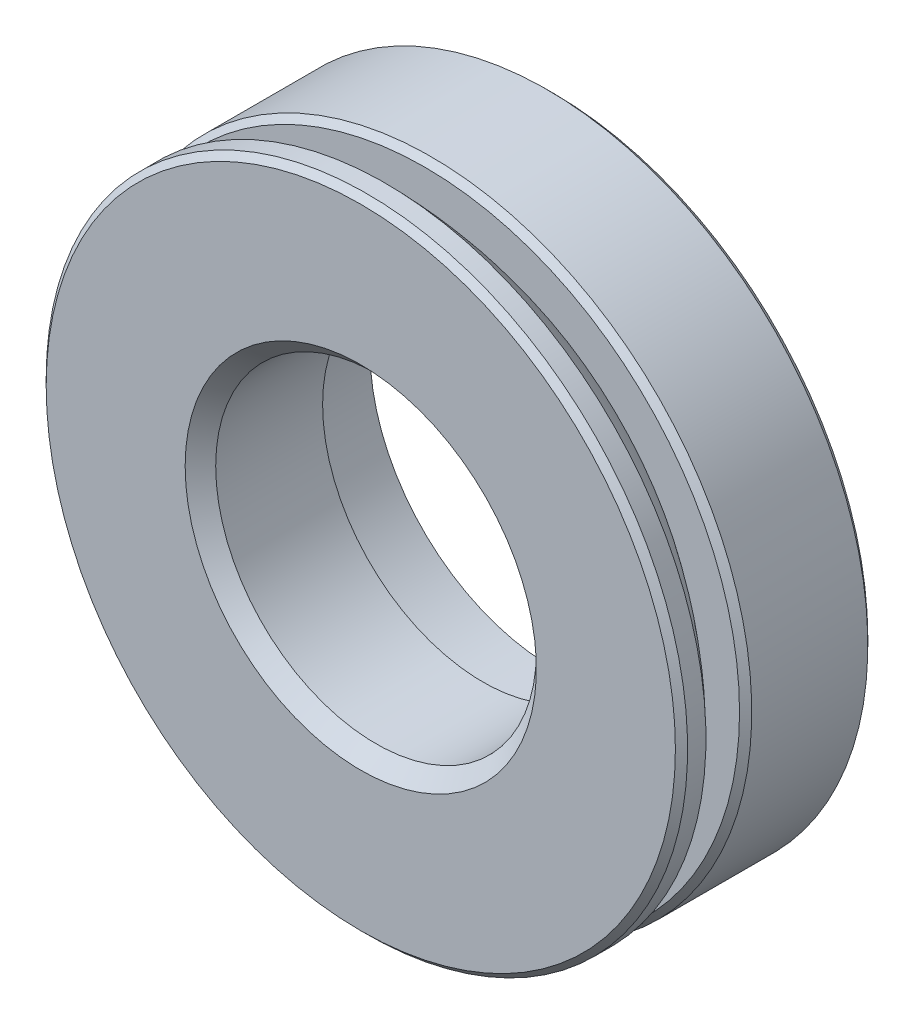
ISO-10303-21;
HEADER;
FILE_DESCRIPTION(('STEP AP214'),'2;1');
FILE_NAME('part.step','',(''),(''),'','','');
FILE_SCHEMA(('AUTOMOTIVE_DESIGN { 1 0 10303 214 1 1 1 1 }'));
ENDSEC;
DATA;
#1=APPLICATION_CONTEXT('core data for automotive mechanical design processes');
#2=APPLICATION_PROTOCOL_DEFINITION('international standard','automotive_design',2000,#1);
#3=PRODUCT_CONTEXT('',#1,'mechanical');
#4=PRODUCT('Part','Part','',(#3));
#5=PRODUCT_RELATED_PRODUCT_CATEGORY('part','',(#4));
#6=PRODUCT_DEFINITION_FORMATION('','',#4);
#7=PRODUCT_DEFINITION_CONTEXT('part definition',#1,'design');
#8=PRODUCT_DEFINITION('design','',#6,#7);
#9=PRODUCT_DEFINITION_SHAPE('','',#8);
#10=(LENGTH_UNIT() NAMED_UNIT(*) SI_UNIT(.MILLI.,.METRE.));
#11=(NAMED_UNIT(*) PLANE_ANGLE_UNIT() SI_UNIT($,.RADIAN.));
#12=(NAMED_UNIT(*) SI_UNIT($,.STERADIAN.) SOLID_ANGLE_UNIT());
#13=UNCERTAINTY_MEASURE_WITH_UNIT(LENGTH_MEASURE(1.E-05),#10,'distance_accuracy_value','');
#14=(GEOMETRIC_REPRESENTATION_CONTEXT(3) GLOBAL_UNCERTAINTY_ASSIGNED_CONTEXT((#13)) GLOBAL_UNIT_ASSIGNED_CONTEXT((#10,
#11,#12)) REPRESENTATION_CONTEXT('',''));
#15=CARTESIAN_POINT('',(0.,0.,0.));
#16=DIRECTION('',(0.,0.,1.));
#17=DIRECTION('',(1.,0.,0.));
#18=AXIS2_PLACEMENT_3D('',#15,#16,#17);
#19=CARTESIAN_POINT('',(0.,0.,8.82361162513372));
#20=DIRECTION('',(0.,0.,1.));
#21=DIRECTION('',(-1.,0.,0.));
#22=AXIS2_PLACEMENT_3D('',#19,#20,#21);
#23=CYLINDRICAL_SURFACE('',#22,6.);
#24=CARTESIAN_POINT('',(0.,0.,0.));
#25=DIRECTION('',(0.,0.,1.));
#26=DIRECTION('',(-1.,0.,0.));
#27=AXIS2_PLACEMENT_3D('',#24,#25,#26);
#28=CIRCLE('',#27,6.);
#29=CARTESIAN_POINT('',(-6.,0.,0.));
#30=VERTEX_POINT('',#29);
#31=EDGE_CURVE('E8',#30,#30,#28,.T.);
#32=ORIENTED_EDGE('',*,*,#31,.F.);
#33=EDGE_LOOP('',(#32));
#34=FACE_BOUND('',#33,.T.);
#35=CARTESIAN_POINT('',(0.,0.,2.30001162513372));
#36=DIRECTION('',(0.,0.,1.));
#37=DIRECTION('',(-1.,0.,0.));
#38=AXIS2_PLACEMENT_3D('',#35,#36,#37);
#39=CIRCLE('',#38,6.);
#40=CARTESIAN_POINT('',(-6.,0.,2.30001162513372));
#41=VERTEX_POINT('',#40);
#42=EDGE_CURVE('E56',#41,#41,#39,.T.);
#43=ORIENTED_EDGE('',*,*,#42,.T.);
#44=EDGE_LOOP('',(#43));
#45=FACE_BOUND('',#44,.T.);
#46=ADVANCED_FACE('F13',(#34,#45),#23,.F.);
#47=CARTESIAN_POINT('',(6.,0.,0.));
#48=DIRECTION('',(0.,0.,1.));
#49=DIRECTION('',(-1.,0.,0.));
#50=AXIS2_PLACEMENT_3D('',#47,#48,#49);
#51=PLANE('',#50);
#52=CARTESIAN_POINT('',(0.,0.,0.));
#53=DIRECTION('',(0.,0.,1.));
#54=DIRECTION('',(-1.,0.,0.));
#55=AXIS2_PLACEMENT_3D('',#52,#53,#54);
#56=CIRCLE('',#55,10.3);
#57=CARTESIAN_POINT('',(-10.3,0.,0.));
#58=VERTEX_POINT('',#57);
#59=EDGE_CURVE('E19',#58,#58,#56,.T.);
#60=ORIENTED_EDGE('',*,*,#59,.F.);
#61=EDGE_LOOP('',(#60));
#62=FACE_BOUND('',#61,.T.);
#63=ORIENTED_EDGE('',*,*,#31,.T.);
#64=EDGE_LOOP('',(#63));
#65=FACE_BOUND('',#64,.T.);
#66=ADVANCED_FACE('F123',(#62,#65),#51,.F.);
#67=CARTESIAN_POINT('',(0.,0.,0.));
#68=DIRECTION('',(0.,0.,1.));
#69=DIRECTION('',(-1.,0.,0.));
#70=AXIS2_PLACEMENT_3D('',#67,#68,#69);
#71=CONICAL_SURFACE('',#70,10.3,0.785398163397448);
#72=CARTESIAN_POINT('',(0.,0.,0.2));
#73=DIRECTION('',(0.,0.,1.));
#74=DIRECTION('',(-1.,0.,0.));
#75=AXIS2_PLACEMENT_3D('',#72,#73,#74);
#76=CIRCLE('',#75,10.5);
#77=CARTESIAN_POINT('',(-10.5,0.,0.2));
#78=VERTEX_POINT('',#77);
#79=EDGE_CURVE('E23',#78,#78,#76,.T.);
#80=ORIENTED_EDGE('',*,*,#79,.F.);
#81=EDGE_LOOP('',(#80));
#82=FACE_BOUND('',#81,.T.);
#83=ORIENTED_EDGE('',*,*,#59,.T.);
#84=EDGE_LOOP('',(#83));
#85=FACE_BOUND('',#84,.T.);
#86=ADVANCED_FACE('F118',(#82,#85),#71,.T.);
#87=CARTESIAN_POINT('',(0.,0.,8.82361162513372));
#88=DIRECTION('',(0.,0.,1.));
#89=DIRECTION('',(-1.,0.,0.));
#90=AXIS2_PLACEMENT_3D('',#87,#88,#89);
#91=CYLINDRICAL_SURFACE('',#90,10.5);
#92=CARTESIAN_POINT('',(0.,0.,4.));
#93=DIRECTION('',(0.,0.,1.));
#94=DIRECTION('',(-1.,0.,0.));
#95=AXIS2_PLACEMENT_3D('',#92,#93,#94);
#96=CIRCLE('',#95,10.5);
#97=CARTESIAN_POINT('',(-10.5,0.,4.));
#98=VERTEX_POINT('',#97);
#99=EDGE_CURVE('E27',#98,#98,#96,.T.);
#100=ORIENTED_EDGE('',*,*,#99,.F.);
#101=EDGE_LOOP('',(#100));
#102=FACE_BOUND('',#101,.T.);
#103=ORIENTED_EDGE('',*,*,#79,.T.);
#104=EDGE_LOOP('',(#103));
#105=FACE_BOUND('',#104,.T.);
#106=ADVANCED_FACE('F112',(#102,#105),#91,.T.);
#107=CARTESIAN_POINT('',(0.,0.,4.));
#108=DIRECTION('',(0.,0.,-1.));
#109=DIRECTION('',(1.,0.,0.));
#110=AXIS2_PLACEMENT_3D('',#107,#108,#109);
#111=CONICAL_SURFACE('',#110,10.5,0.785398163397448);
#112=CARTESIAN_POINT('',(0.,0.,4.2));
#113=DIRECTION('',(0.,0.,1.));
#114=DIRECTION('',(-1.,0.,0.));
#115=AXIS2_PLACEMENT_3D('',#112,#113,#114);
#116=CIRCLE('',#115,10.3);
#117=CARTESIAN_POINT('',(-10.3,0.,4.2));
#118=VERTEX_POINT('',#117);
#119=EDGE_CURVE('E32',#118,#118,#116,.T.);
#120=ORIENTED_EDGE('',*,*,#119,.F.);
#121=EDGE_LOOP('',(#120));
#122=FACE_BOUND('',#121,.T.);
#123=ORIENTED_EDGE('',*,*,#99,.T.);
#124=EDGE_LOOP('',(#123));
#125=FACE_BOUND('',#124,.T.);
#126=ADVANCED_FACE('F106',(#122,#125),#111,.T.);
#127=CARTESIAN_POINT('',(8.98415477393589,0.,4.2));
#128=DIRECTION('',(0.,0.,-1.));
#129=DIRECTION('',(1.,0.,0.));
#130=AXIS2_PLACEMENT_3D('',#127,#128,#129);
#131=PLANE('',#130);
#132=CARTESIAN_POINT('',(0.,0.,4.2));
#133=DIRECTION('',(0.,0.,1.));
#134=DIRECTION('',(-1.,0.,0.));
#135=AXIS2_PLACEMENT_3D('',#132,#133,#134);
#136=CIRCLE('',#135,8.98415477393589);
#137=CARTESIAN_POINT('',(-8.98415477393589,0.,4.2));
#138=VERTEX_POINT('',#137);
#139=EDGE_CURVE('E35',#138,#138,#136,.T.);
#140=ORIENTED_EDGE('',*,*,#139,.F.);
#141=EDGE_LOOP('',(#140));
#142=FACE_BOUND('',#141,.T.);
#143=ORIENTED_EDGE('',*,*,#119,.T.);
#144=EDGE_LOOP('',(#143));
#145=FACE_BOUND('',#144,.T.);
#146=ADVANCED_FACE('F100',(#142,#145),#131,.F.);
#147=CARTESIAN_POINT('',(0.,0.,16.2109444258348));
#148=DIRECTION('',(0.,0.,1.));
#149=DIRECTION('',(-1.,0.,0.));
#150=AXIS2_PLACEMENT_3D('',#147,#148,#149);
#151=DEGENERATE_TOROIDAL_SURFACE('',#150,0.00123414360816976,15.0000000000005,.F.);
#152=CARTESIAN_POINT('',(0.,0.,5.50001162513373));
#153=DIRECTION('',(0.,0.,1.));
#154=DIRECTION('',(-1.,0.,0.));
#155=AXIS2_PLACEMENT_3D('',#152,#153,#154);
#156=CIRCLE('',#155,10.5);
#157=CARTESIAN_POINT('',(-10.5,0.,5.50001162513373));
#158=VERTEX_POINT('',#157);
#159=EDGE_CURVE('E38',#158,#158,#156,.T.);
#160=ORIENTED_EDGE('',*,*,#159,.F.);
#161=EDGE_LOOP('',(#160));
#162=FACE_BOUND('',#161,.T.);
#163=ORIENTED_EDGE('',*,*,#139,.T.);
#164=EDGE_LOOP('',(#163));
#165=FACE_BOUND('',#164,.T.);
#166=ADVANCED_FACE('F94',(#162,#165),#151,.F.);
#167=CARTESIAN_POINT('',(0.,0.,8.82361162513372));
#168=DIRECTION('',(0.,0.,1.));
#169=DIRECTION('',(-1.,0.,0.));
#170=AXIS2_PLACEMENT_3D('',#167,#168,#169);
#171=CYLINDRICAL_SURFACE('',#170,10.5);
#172=CARTESIAN_POINT('',(0.,0.,6.10001162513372));
#173=DIRECTION('',(0.,0.,1.));
#174=DIRECTION('',(-1.,0.,0.));
#175=AXIS2_PLACEMENT_3D('',#172,#173,#174);
#176=CIRCLE('',#175,10.5);
#177=CARTESIAN_POINT('',(-10.5,0.,6.10001162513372));
#178=VERTEX_POINT('',#177);
#179=EDGE_CURVE('E41',#178,#178,#176,.T.);
#180=ORIENTED_EDGE('',*,*,#179,.F.);
#181=EDGE_LOOP('',(#180));
#182=FACE_BOUND('',#181,.T.);
#183=ORIENTED_EDGE('',*,*,#159,.T.);
#184=EDGE_LOOP('',(#183));
#185=FACE_BOUND('',#184,.T.);
#186=ADVANCED_FACE('F88',(#182,#185),#171,.T.);
#187=CARTESIAN_POINT('',(0.,0.,6.10001162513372));
#188=DIRECTION('',(0.,0.,-1.));
#189=DIRECTION('',(1.,0.,0.));
#190=AXIS2_PLACEMENT_3D('',#187,#188,#189);
#191=CONICAL_SURFACE('',#190,10.5,0.785398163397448);
#192=CARTESIAN_POINT('',(0.,0.,6.30001162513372));
#193=DIRECTION('',(0.,0.,1.));
#194=DIRECTION('',(-1.,0.,0.));
#195=AXIS2_PLACEMENT_3D('',#192,#193,#194);
#196=CIRCLE('',#195,10.3);
#197=CARTESIAN_POINT('',(-10.3,0.,6.30001162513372));
#198=VERTEX_POINT('',#197);
#199=EDGE_CURVE('E44',#198,#198,#196,.T.);
#200=ORIENTED_EDGE('',*,*,#199,.F.);
#201=EDGE_LOOP('',(#200));
#202=FACE_BOUND('',#201,.T.);
#203=ORIENTED_EDGE('',*,*,#179,.T.);
#204=EDGE_LOOP('',(#203));
#205=FACE_BOUND('',#204,.T.);
#206=ADVANCED_FACE('F82',(#202,#205),#191,.T.);
#207=CARTESIAN_POINT('',(10.3,0.,6.30001162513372));
#208=DIRECTION('',(0.,0.,-1.));
#209=DIRECTION('',(1.,0.,0.));
#210=AXIS2_PLACEMENT_3D('',#207,#208,#209);
#211=PLANE('',#210);
#212=CARTESIAN_POINT('',(0.,0.,6.30001162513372));
#213=DIRECTION('',(0.,0.,1.));
#214=DIRECTION('',(-1.,0.,0.));
#215=AXIS2_PLACEMENT_3D('',#212,#213,#214);
#216=CIRCLE('',#215,5.75);
#217=CARTESIAN_POINT('',(-5.75,0.,6.30001162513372));
#218=VERTEX_POINT('',#217);
#219=EDGE_CURVE('E47',#218,#218,#216,.T.);
#220=ORIENTED_EDGE('',*,*,#219,.F.);
#221=EDGE_LOOP('',(#220));
#222=FACE_BOUND('',#221,.T.);
#223=ORIENTED_EDGE('',*,*,#199,.T.);
#224=EDGE_LOOP('',(#223));
#225=FACE_BOUND('',#224,.T.);
#226=ADVANCED_FACE('F76',(#222,#225),#211,.F.);
#227=CARTESIAN_POINT('',(0.,0.,6.30001162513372));
#228=DIRECTION('',(0.,0.,1.));
#229=DIRECTION('',(-1.,0.,0.));
#230=AXIS2_PLACEMENT_3D('',#227,#228,#229);
#231=CONICAL_SURFACE('',#230,5.75,0.785398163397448);
#232=CARTESIAN_POINT('',(0.,0.,5.80001162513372));
#233=DIRECTION('',(0.,0.,1.));
#234=DIRECTION('',(-1.,0.,0.));
#235=AXIS2_PLACEMENT_3D('',#232,#233,#234);
#236=CIRCLE('',#235,5.25);
#237=CARTESIAN_POINT('',(-5.25,0.,5.80001162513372));
#238=VERTEX_POINT('',#237);
#239=EDGE_CURVE('E50',#238,#238,#236,.T.);
#240=ORIENTED_EDGE('',*,*,#239,.F.);
#241=EDGE_LOOP('',(#240));
#242=FACE_BOUND('',#241,.T.);
#243=ORIENTED_EDGE('',*,*,#219,.T.);
#244=EDGE_LOOP('',(#243));
#245=FACE_BOUND('',#244,.T.);
#246=ADVANCED_FACE('F70',(#242,#245),#231,.F.);
#247=CARTESIAN_POINT('',(0.,0.,8.82361162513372));
#248=DIRECTION('',(0.,0.,1.));
#249=DIRECTION('',(-1.,0.,0.));
#250=AXIS2_PLACEMENT_3D('',#247,#248,#249);
#251=CYLINDRICAL_SURFACE('',#250,5.25);
#252=CARTESIAN_POINT('',(0.,0.,2.30001162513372));
#253=DIRECTION('',(0.,0.,1.));
#254=DIRECTION('',(-1.,0.,0.));
#255=AXIS2_PLACEMENT_3D('',#252,#253,#254);
#256=CIRCLE('',#255,5.25);
#257=CARTESIAN_POINT('',(-5.25,0.,2.30001162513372));
#258=VERTEX_POINT('',#257);
#259=EDGE_CURVE('E53',#258,#258,#256,.T.);
#260=ORIENTED_EDGE('',*,*,#259,.F.);
#261=EDGE_LOOP('',(#260));
#262=FACE_BOUND('',#261,.T.);
#263=ORIENTED_EDGE('',*,*,#239,.T.);
#264=EDGE_LOOP('',(#263));
#265=FACE_BOUND('',#264,.T.);
#266=ADVANCED_FACE('F64',(#262,#265),#251,.F.);
#267=CARTESIAN_POINT('',(6.,0.,2.30001162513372));
#268=DIRECTION('',(0.,0.,1.));
#269=DIRECTION('',(-1.,0.,0.));
#270=AXIS2_PLACEMENT_3D('',#267,#268,#269);
#271=PLANE('',#270);
#272=ORIENTED_EDGE('',*,*,#42,.F.);
#273=EDGE_LOOP('',(#272));
#274=FACE_BOUND('',#273,.T.);
#275=ORIENTED_EDGE('',*,*,#259,.T.);
#276=EDGE_LOOP('',(#275));
#277=FACE_BOUND('',#276,.T.);
#278=ADVANCED_FACE('F61',(#274,#277),#271,.F.);
#279=CLOSED_SHELL('',(#46,#66,#86,#106,#126,#146,#166,#186,#206,#226,#246,#266,#278));
#280=MANIFOLD_SOLID_BREP('B1',#279);
#281=ADVANCED_BREP_SHAPE_REPRESENTATION('',(#18,#280),#14);
#282=SHAPE_DEFINITION_REPRESENTATION(#9,#281);
ENDSEC;
END-ISO-10303-21;
